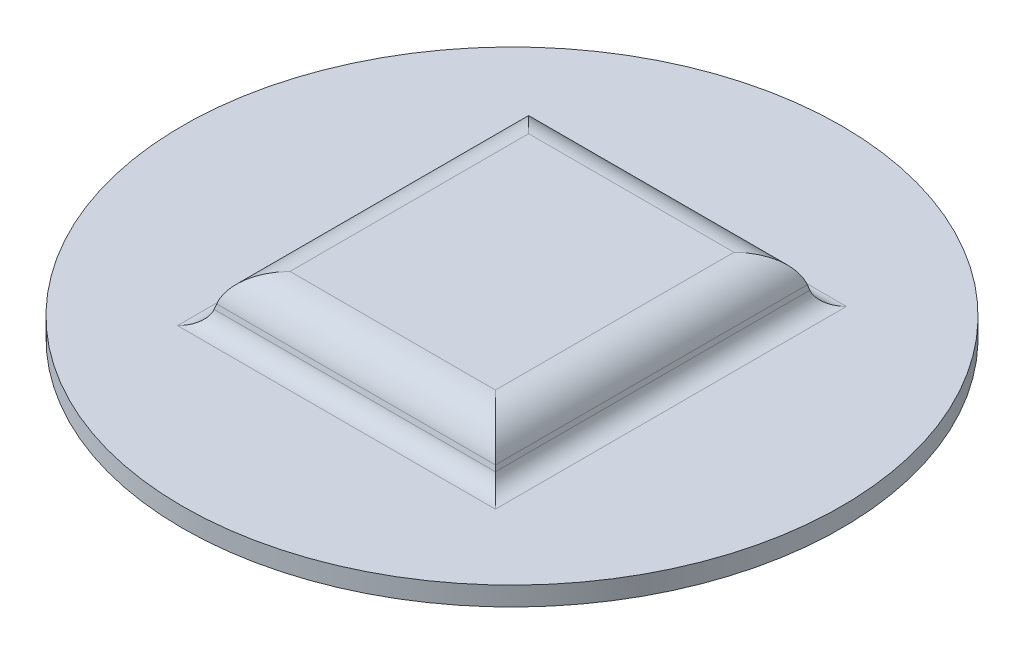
ISO-10303-21;
HEADER;
FILE_DESCRIPTION(('STEP AP214'),'2;1');
FILE_NAME('part.step','',(''),(''),'','','');
FILE_SCHEMA(('AUTOMOTIVE_DESIGN { 1 0 10303 214 1 1 1 1 }'));
ENDSEC;
DATA;
#1=APPLICATION_CONTEXT('core data for automotive mechanical design processes');
#2=APPLICATION_PROTOCOL_DEFINITION('international standard','automotive_design',2000,#1);
#3=PRODUCT_CONTEXT('',#1,'mechanical');
#4=PRODUCT('Part','Part','',(#3));
#5=PRODUCT_RELATED_PRODUCT_CATEGORY('part','',(#4));
#6=PRODUCT_DEFINITION_FORMATION('','',#4);
#7=PRODUCT_DEFINITION_CONTEXT('part definition',#1,'design');
#8=PRODUCT_DEFINITION('design','',#6,#7);
#9=PRODUCT_DEFINITION_SHAPE('','',#8);
#10=(LENGTH_UNIT() NAMED_UNIT(*) SI_UNIT(.MILLI.,.METRE.));
#11=(NAMED_UNIT(*) PLANE_ANGLE_UNIT() SI_UNIT($,.RADIAN.));
#12=(NAMED_UNIT(*) SI_UNIT($,.STERADIAN.) SOLID_ANGLE_UNIT());
#13=UNCERTAINTY_MEASURE_WITH_UNIT(LENGTH_MEASURE(1.E-05),#10,'distance_accuracy_value','');
#14=(GEOMETRIC_REPRESENTATION_CONTEXT(3) GLOBAL_UNCERTAINTY_ASSIGNED_CONTEXT((#13)) GLOBAL_UNIT_ASSIGNED_CONTEXT((#10,
#11,#12)) REPRESENTATION_CONTEXT('',''));
#15=CARTESIAN_POINT('',(0.,0.,0.));
#16=DIRECTION('',(0.,0.,1.));
#17=DIRECTION('',(1.,0.,0.));
#18=AXIS2_PLACEMENT_3D('',#15,#16,#17);
#19=CARTESIAN_POINT('',(0.,-0.9144,0.));
#20=DIRECTION('',(0.,1.,0.));
#21=DIRECTION('',(0.,0.,1.));
#22=AXIS2_PLACEMENT_3D('',#19,#20,#21);
#23=PLANE('',#22);
#24=DIRECTION('',(1.,0.,0.));
#25=VECTOR('',#24,1.);
#26=CARTESIAN_POINT('',(0.,-0.9144,7.04570394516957));
#27=LINE('',#26,#25);
#28=CARTESIAN_POINT('',(5.23447675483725,-0.9144,7.04570394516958));
#29=VERTEX_POINT('',#28);
#30=CARTESIAN_POINT('',(-4.6589480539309,-0.9144,7.04570394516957));
#31=VERTEX_POINT('',#30);
#32=EDGE_CURVE('E145',#29,#31,#27,.F.);
#33=ORIENTED_EDGE('',*,*,#32,.T.);
#34=DIRECTION('',(0.,0.,1.));
#35=VECTOR('',#34,1.);
#36=CARTESIAN_POINT('',(-4.6589480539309,-0.9144,0.));
#37=LINE('',#36,#35);
#38=CARTESIAN_POINT('',(-4.6589480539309,-0.9144,-4.44792086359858));
#39=VERTEX_POINT('',#38);
#40=EDGE_CURVE('E137',#31,#39,#37,.F.);
#41=ORIENTED_EDGE('',*,*,#40,.T.);
#42=DIRECTION('',(-1.,0.,0.));
#43=VECTOR('',#42,1.);
#44=CARTESIAN_POINT('',(0.,-0.9144,-4.44792086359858));
#45=LINE('',#44,#43);
#46=CARTESIAN_POINT('',(5.23447675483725,-0.9144,-4.44792086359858));
#47=VERTEX_POINT('',#46);
#48=EDGE_CURVE('E127',#39,#47,#45,.F.);
#49=ORIENTED_EDGE('',*,*,#48,.T.);
#50=DIRECTION('',(0.,0.,-1.));
#51=VECTOR('',#50,1.);
#52=CARTESIAN_POINT('',(5.23447675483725,-0.9144,0.));
#53=LINE('',#52,#51);
#54=EDGE_CURVE('E201',#47,#29,#53,.F.);
#55=ORIENTED_EDGE('',*,*,#54,.T.);
#56=EDGE_LOOP('',(#33,#41,#49,#55));
#57=FACE_BOUND('',#56,.T.);
#58=ADVANCED_FACE('F18',(#57),#23,.F.);
#59=CARTESIAN_POINT('',(0.,-1.8288,-4.44792086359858));
#60=DIRECTION('',(-1.,0.,0.));
#61=DIRECTION('',(0.,0.,1.));
#62=AXIS2_PLACEMENT_3D('',#59,#60,#61);
#63=CYLINDRICAL_SURFACE('',#62,0.9144);
#64=ORIENTED_EDGE('',*,*,#48,.F.);
#65=CARTESIAN_POINT('',(-4.6589480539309,-1.8288,-4.44792086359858));
#66=DIRECTION('',(-0.707106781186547,0.,0.707106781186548));
#67=DIRECTION('',(0.707106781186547,0.,0.707106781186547));
#68=AXIS2_PLACEMENT_3D('',#65,#66,#67);
#69=ELLIPSE('',#68,1.29315688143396,0.9144);
#70=CARTESIAN_POINT('',(-5.54219062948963,-1.59213586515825,-5.3311634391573));
#71=VERTEX_POINT('',#70);
#72=EDGE_CURVE('E21',#39,#71,#69,.T.);
#73=ORIENTED_EDGE('',*,*,#72,.T.);
#74=DIRECTION('',(1.,0.,0.));
#75=VECTOR('',#74,1.);
#76=CARTESIAN_POINT('',(-6.06223564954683,-1.59213586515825,-5.3311634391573));
#77=LINE('',#76,#75);
#78=CARTESIAN_POINT('',(6.11771933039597,-1.59213586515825,-5.3311634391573));
#79=VERTEX_POINT('',#78);
#80=EDGE_CURVE('E200',#71,#79,#77,.T.);
#81=ORIENTED_EDGE('',*,*,#80,.T.);
#82=CARTESIAN_POINT('',(5.23447675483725,-1.8288,-4.44792086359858));
#83=DIRECTION('',(-0.707106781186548,0.,-0.707106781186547));
#84=DIRECTION('',(0.707106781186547,0.,-0.707106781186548));
#85=AXIS2_PLACEMENT_3D('',#82,#83,#84);
#86=ELLIPSE('',#85,1.29315688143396,0.9144);
#87=EDGE_CURVE('E132',#79,#47,#86,.F.);
#88=ORIENTED_EDGE('',*,*,#87,.T.);
#89=EDGE_LOOP('',(#64,#73,#81,#88));
#90=FACE_BOUND('',#89,.T.);
#91=ADVANCED_FACE('F129',(#90),#63,.F.);
#92=CARTESIAN_POINT('',(-4.6589480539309,-1.8288,0.));
#93=DIRECTION('',(0.,0.,1.));
#94=DIRECTION('',(1.,0.,0.));
#95=AXIS2_PLACEMENT_3D('',#92,#93,#94);
#96=CYLINDRICAL_SURFACE('',#95,0.9144);
#97=DIRECTION('',(0.,0.,1.));
#98=VECTOR('',#97,1.);
#99=CARTESIAN_POINT('',(-5.54219062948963,-1.59213586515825,-5.8512084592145));
#100=LINE('',#99,#98);
#101=CARTESIAN_POINT('',(-5.54219062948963,-1.59213586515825,7.9289465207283));
#102=VERTEX_POINT('',#101);
#103=EDGE_CURVE('E144',#102,#71,#100,.F.);
#104=ORIENTED_EDGE('',*,*,#103,.T.);
#105=ORIENTED_EDGE('',*,*,#72,.F.);
#106=ORIENTED_EDGE('',*,*,#40,.F.);
#107=CARTESIAN_POINT('',(-4.6589480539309,-1.8288,7.04570394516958));
#108=DIRECTION('',(0.707106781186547,0.,0.707106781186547));
#109=DIRECTION('',(0.707106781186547,0.,-0.707106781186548));
#110=AXIS2_PLACEMENT_3D('',#107,#108,#109);
#111=ELLIPSE('',#110,1.29315688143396,0.9144);
#112=EDGE_CURVE('E202',#31,#102,#111,.T.);
#113=ORIENTED_EDGE('',*,*,#112,.T.);
#114=EDGE_LOOP('',(#104,#105,#106,#113));
#115=FACE_BOUND('',#114,.T.);
#116=ADVANCED_FACE('F141',(#115),#96,.F.);
#117=CARTESIAN_POINT('',(0.,-1.8288,7.04570394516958));
#118=DIRECTION('',(1.,0.,0.));
#119=DIRECTION('',(0.,0.,-1.));
#120=AXIS2_PLACEMENT_3D('',#117,#118,#119);
#121=CYLINDRICAL_SURFACE('',#120,0.9144);
#122=ORIENTED_EDGE('',*,*,#32,.F.);
#123=CARTESIAN_POINT('',(5.23447675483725,-1.8288,7.04570394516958));
#124=DIRECTION('',(0.707106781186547,0.,-0.707106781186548));
#125=DIRECTION('',(-0.707106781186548,0.,-0.707106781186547));
#126=AXIS2_PLACEMENT_3D('',#123,#124,#125);
#127=ELLIPSE('',#126,1.29315688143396,0.9144);
#128=CARTESIAN_POINT('',(6.11771933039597,-1.59213586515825,7.9289465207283));
#129=VERTEX_POINT('',#128);
#130=EDGE_CURVE('E197',#29,#129,#127,.T.);
#131=ORIENTED_EDGE('',*,*,#130,.T.);
#132=DIRECTION('',(1.,0.,0.));
#133=VECTOR('',#132,1.);
#134=CARTESIAN_POINT('',(-6.06223564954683,-1.59213586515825,7.9289465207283));
#135=LINE('',#134,#133);
#136=EDGE_CURVE('E212',#129,#102,#135,.F.);
#137=ORIENTED_EDGE('',*,*,#136,.T.);
#138=ORIENTED_EDGE('',*,*,#112,.F.);
#139=EDGE_LOOP('',(#122,#131,#137,#138));
#140=FACE_BOUND('',#139,.T.);
#141=ADVANCED_FACE('F217',(#140),#121,.F.);
#142=CARTESIAN_POINT('',(5.23447675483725,-1.8288,0.));
#143=DIRECTION('',(0.,0.,-1.));
#144=DIRECTION('',(-1.,0.,0.));
#145=AXIS2_PLACEMENT_3D('',#142,#143,#144);
#146=CYLINDRICAL_SURFACE('',#145,0.9144);
#147=ORIENTED_EDGE('',*,*,#54,.F.);
#148=ORIENTED_EDGE('',*,*,#87,.F.);
#149=DIRECTION('',(0.,0.,1.));
#150=VECTOR('',#149,1.);
#151=CARTESIAN_POINT('',(6.11771933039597,-1.59213586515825,-5.8512084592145));
#152=LINE('',#151,#150);
#153=EDGE_CURVE('E225',#79,#129,#152,.T.);
#154=ORIENTED_EDGE('',*,*,#153,.T.);
#155=ORIENTED_EDGE('',*,*,#130,.F.);
#156=EDGE_LOOP('',(#147,#148,#154,#155));
#157=FACE_BOUND('',#156,.T.);
#158=ADVANCED_FACE('F349',(#157),#146,.F.);
#159=CARTESIAN_POINT('',(0.,0.,0.));
#160=DIRECTION('',(0.,1.,0.));
#161=DIRECTION('',(0.,0.,1.));
#162=AXIS2_PLACEMENT_3D('',#159,#160,#161);
#163=PLANE('',#162);
#164=DIRECTION('',(0.,0.,1.));
#165=VECTOR('',#164,1.);
#166=CARTESIAN_POINT('',(-4.6589480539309,0.,0.));
#167=LINE('',#166,#165);
#168=CARTESIAN_POINT('',(-4.6589480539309,0.,7.04570394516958));
#169=VERTEX_POINT('',#168);
#170=CARTESIAN_POINT('',(-4.6589480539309,0.,-4.44792086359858));
#171=VERTEX_POINT('',#170);
#172=EDGE_CURVE('E196',#169,#171,#167,.F.);
#173=ORIENTED_EDGE('',*,*,#172,.F.);
#174=DIRECTION('',(1.,0.,0.));
#175=VECTOR('',#174,1.);
#176=CARTESIAN_POINT('',(0.,0.,7.04570394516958));
#177=LINE('',#176,#175);
#178=CARTESIAN_POINT('',(5.23447675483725,0.,7.04570394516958));
#179=VERTEX_POINT('',#178);
#180=EDGE_CURVE('E193',#179,#169,#177,.F.);
#181=ORIENTED_EDGE('',*,*,#180,.F.);
#182=DIRECTION('',(0.,0.,-1.));
#183=VECTOR('',#182,1.);
#184=CARTESIAN_POINT('',(5.23447675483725,0.,0.));
#185=LINE('',#184,#183);
#186=CARTESIAN_POINT('',(5.23447675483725,0.,-4.44792086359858));
#187=VERTEX_POINT('',#186);
#188=EDGE_CURVE('E190',#187,#179,#185,.F.);
#189=ORIENTED_EDGE('',*,*,#188,.F.);
#190=DIRECTION('',(-1.,0.,0.));
#191=VECTOR('',#190,1.);
#192=CARTESIAN_POINT('',(0.,0.,-4.44792086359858));
#193=LINE('',#192,#191);
#194=EDGE_CURVE('E187',#171,#187,#193,.F.);
#195=ORIENTED_EDGE('',*,*,#194,.F.);
#196=EDGE_LOOP('',(#173,#181,#189,#195));
#197=FACE_BOUND('',#196,.T.);
#198=ADVANCED_FACE('F347',(#197),#163,.T.);
#199=CARTESIAN_POINT('',(-6.06223564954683,-0.236664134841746,-4.96796588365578));
#200=DIRECTION('',(0.,0.258819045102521,-0.965925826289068));
#201=DIRECTION('',(0.,0.965925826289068,0.258819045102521));
#202=AXIS2_PLACEMENT_3D('',#199,#200,#201);
#203=PLANE('',#202);
#204=ORIENTED_EDGE('',*,*,#80,.F.);
#205=DIRECTION('',(-0.250562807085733,-0.935113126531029,-0.250562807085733));
#206=VECTOR('',#205,1.);
#207=CARTESIAN_POINT('',(-5.54219062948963,-1.59213586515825,-5.3311634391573));
#208=LINE('',#207,#206);
#209=CARTESIAN_POINT('',(-5.60312024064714,-1.81952826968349,-5.39209305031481));
#210=VERTEX_POINT('',#209);
#211=EDGE_CURVE('E220',#71,#210,#208,.T.);
#212=ORIENTED_EDGE('',*,*,#211,.T.);
#213=DIRECTION('',(-1.,0.,0.));
#214=VECTOR('',#213,1.);
#215=CARTESIAN_POINT('',(-6.06223564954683,-1.81952826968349,-5.39209305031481));
#216=LINE('',#215,#214);
#217=CARTESIAN_POINT('',(6.17864894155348,-1.81952826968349,-5.39209305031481));
#218=VERTEX_POINT('',#217);
#219=EDGE_CURVE('E183',#218,#210,#216,.T.);
#220=ORIENTED_EDGE('',*,*,#219,.F.);
#221=DIRECTION('',(-0.250562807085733,0.935113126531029,0.250562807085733));
#222=VECTOR('',#221,1.);
#223=CARTESIAN_POINT('',(6.17864894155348,-1.81952826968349,-5.39209305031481));
#224=LINE('',#223,#222);
#225=EDGE_CURVE('E215',#218,#79,#224,.T.);
#226=ORIENTED_EDGE('',*,*,#225,.T.);
#227=EDGE_LOOP('',(#204,#212,#220,#226));
#228=FACE_BOUND('',#227,.T.);
#229=ADVANCED_FACE('F240',(#228),#203,.F.);
#230=CARTESIAN_POINT('',(-5.1789930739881,-0.236664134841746,-5.8512084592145));
#231=DIRECTION('',(-0.965925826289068,0.258819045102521,0.));
#232=DIRECTION('',(-0.258819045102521,-0.965925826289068,0.));
#233=AXIS2_PLACEMENT_3D('',#230,#231,#232);
#234=PLANE('',#233);
#235=ORIENTED_EDGE('',*,*,#103,.F.);
#236=DIRECTION('',(-0.250562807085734,-0.935113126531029,0.25056280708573));
#237=VECTOR('',#236,1.);
#238=CARTESIAN_POINT('',(-5.54219062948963,-1.59213586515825,7.9289465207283));
#239=LINE('',#238,#237);
#240=CARTESIAN_POINT('',(-5.60312024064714,-1.81952826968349,7.98987613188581));
#241=VERTEX_POINT('',#240);
#242=EDGE_CURVE('E209',#102,#241,#239,.T.);
#243=ORIENTED_EDGE('',*,*,#242,.T.);
#244=DIRECTION('',(0.,0.,1.));
#245=VECTOR('',#244,1.);
#246=CARTESIAN_POINT('',(-5.60312024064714,-1.81952826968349,-5.8512084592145));
#247=LINE('',#246,#245);
#248=EDGE_CURVE('E179',#210,#241,#247,.T.);
#249=ORIENTED_EDGE('',*,*,#248,.F.);
#250=ORIENTED_EDGE('',*,*,#211,.F.);
#251=EDGE_LOOP('',(#235,#243,#249,#250));
#252=FACE_BOUND('',#251,.T.);
#253=ADVANCED_FACE('F356',(#252),#234,.F.);
#254=CARTESIAN_POINT('',(-6.06223564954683,-0.236664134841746,7.56574896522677));
#255=DIRECTION('',(0.,0.258819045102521,0.965925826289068));
#256=DIRECTION('',(0.,-0.965925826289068,0.258819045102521));
#257=AXIS2_PLACEMENT_3D('',#254,#255,#256);
#258=PLANE('',#257);
#259=ORIENTED_EDGE('',*,*,#136,.F.);
#260=DIRECTION('',(0.250562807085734,-0.935113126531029,0.25056280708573));
#261=VECTOR('',#260,1.);
#262=CARTESIAN_POINT('',(6.11771933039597,-1.59213586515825,7.92894652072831));
#263=LINE('',#262,#261);
#264=CARTESIAN_POINT('',(6.17864894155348,-1.81952826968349,7.98987613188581));
#265=VERTEX_POINT('',#264);
#266=EDGE_CURVE('E228',#129,#265,#263,.T.);
#267=ORIENTED_EDGE('',*,*,#266,.T.);
#268=DIRECTION('',(1.,0.,0.));
#269=VECTOR('',#268,1.);
#270=CARTESIAN_POINT('',(-6.06223564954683,-1.81952826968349,7.98987613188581));
#271=LINE('',#270,#269);
#272=EDGE_CURVE('E175',#241,#265,#271,.T.);
#273=ORIENTED_EDGE('',*,*,#272,.F.);
#274=ORIENTED_EDGE('',*,*,#242,.F.);
#275=EDGE_LOOP('',(#259,#267,#273,#274));
#276=FACE_BOUND('',#275,.T.);
#277=ADVANCED_FACE('F210',(#276),#258,.F.);
#278=CARTESIAN_POINT('',(5.75452177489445,-0.236664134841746,-5.8512084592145));
#279=DIRECTION('',(0.965925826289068,0.258819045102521,0.));
#280=DIRECTION('',(-0.258819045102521,0.965925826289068,0.));
#281=AXIS2_PLACEMENT_3D('',#278,#279,#280);
#282=PLANE('',#281);
#283=ORIENTED_EDGE('',*,*,#153,.F.);
#284=ORIENTED_EDGE('',*,*,#225,.F.);
#285=DIRECTION('',(0.,0.,-1.));
#286=VECTOR('',#285,1.);
#287=CARTESIAN_POINT('',(6.17864894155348,-1.81952826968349,-5.8512084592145));
#288=LINE('',#287,#286);
#289=EDGE_CURVE('E171',#265,#218,#288,.T.);
#290=ORIENTED_EDGE('',*,*,#289,.F.);
#291=ORIENTED_EDGE('',*,*,#266,.F.);
#292=EDGE_LOOP('',(#283,#284,#290,#291));
#293=FACE_BOUND('',#292,.T.);
#294=ADVANCED_FACE('F235',(#293),#282,.F.);
#295=CARTESIAN_POINT('',(-4.6589480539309,-1.8288,0.));
#296=DIRECTION('',(0.,0.,1.));
#297=DIRECTION('',(1.,0.,0.));
#298=AXIS2_PLACEMENT_3D('',#295,#296,#297);
#299=CYLINDRICAL_SURFACE('',#298,1.8288);
#300=CARTESIAN_POINT('',(-4.6589480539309,-1.8288,-4.44792086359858));
#301=DIRECTION('',(-0.707106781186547,0.,0.707106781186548));
#302=DIRECTION('',(-0.707106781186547,0.,-0.707106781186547));
#303=AXIS2_PLACEMENT_3D('',#300,#301,#302);
#304=ELLIPSE('',#303,2.58631376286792,1.8288);
#305=CARTESIAN_POINT('',(-6.42543320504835,-1.35547173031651,-6.21440601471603));
#306=VERTEX_POINT('',#305);
#307=EDGE_CURVE('E184',#306,#171,#304,.F.);
#308=ORIENTED_EDGE('',*,*,#307,.F.);
#309=DIRECTION('',(0.,0.,1.));
#310=VECTOR('',#309,1.);
#311=CARTESIAN_POINT('',(-6.42543320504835,-1.35547173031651,-5.8512084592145));
#312=LINE('',#311,#310);
#313=CARTESIAN_POINT('',(-6.42543320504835,-1.35547173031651,8.81218909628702));
#314=VERTEX_POINT('',#313);
#315=EDGE_CURVE('E170',#314,#306,#312,.F.);
#316=ORIENTED_EDGE('',*,*,#315,.F.);
#317=CARTESIAN_POINT('',(-4.6589480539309,-1.8288,7.04570394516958));
#318=DIRECTION('',(0.707106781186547,0.,0.707106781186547));
#319=DIRECTION('',(0.707106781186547,0.,-0.707106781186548));
#320=AXIS2_PLACEMENT_3D('',#317,#318,#319);
#321=ELLIPSE('',#320,2.58631376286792,1.8288);
#322=EDGE_CURVE('E194',#169,#314,#321,.T.);
#323=ORIENTED_EDGE('',*,*,#322,.F.);
#324=ORIENTED_EDGE('',*,*,#172,.T.);
#325=EDGE_LOOP('',(#308,#316,#323,#324));
#326=FACE_BOUND('',#325,.T.);
#327=ADVANCED_FACE('F328',(#326),#299,.T.);
#328=CARTESIAN_POINT('',(0.,-1.8288,7.04570394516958));
#329=DIRECTION('',(1.,0.,0.));
#330=DIRECTION('',(0.,0.,-1.));
#331=AXIS2_PLACEMENT_3D('',#328,#329,#330);
#332=CYLINDRICAL_SURFACE('',#331,1.8288);
#333=CARTESIAN_POINT('',(5.23447675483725,-1.8288,7.04570394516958));
#334=DIRECTION('',(0.707106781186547,0.,-0.707106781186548));
#335=DIRECTION('',(-0.707106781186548,0.,-0.707106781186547));
#336=AXIS2_PLACEMENT_3D('',#333,#334,#335);
#337=ELLIPSE('',#336,2.58631376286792,1.8288);
#338=CARTESIAN_POINT('',(7.0009619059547,-1.35547173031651,8.81218909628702));
#339=VERTEX_POINT('',#338);
#340=EDGE_CURVE('E191',#179,#339,#337,.T.);
#341=ORIENTED_EDGE('',*,*,#340,.F.);
#342=ORIENTED_EDGE('',*,*,#180,.T.);
#343=ORIENTED_EDGE('',*,*,#322,.T.);
#344=DIRECTION('',(1.,0.,0.));
#345=VECTOR('',#344,1.);
#346=CARTESIAN_POINT('',(-6.06223564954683,-1.35547173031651,8.81218909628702));
#347=LINE('',#346,#345);
#348=EDGE_CURVE('E248',#339,#314,#347,.F.);
#349=ORIENTED_EDGE('',*,*,#348,.F.);
#350=EDGE_LOOP('',(#341,#342,#343,#349));
#351=FACE_BOUND('',#350,.T.);
#352=ADVANCED_FACE('F336',(#351),#332,.T.);
#353=CARTESIAN_POINT('',(5.23447675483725,-1.8288,0.));
#354=DIRECTION('',(0.,0.,-1.));
#355=DIRECTION('',(-1.,0.,0.));
#356=AXIS2_PLACEMENT_3D('',#353,#354,#355);
#357=CYLINDRICAL_SURFACE('',#356,1.8288);
#358=CARTESIAN_POINT('',(5.23447675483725,-1.8288,-4.44792086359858));
#359=DIRECTION('',(-0.707106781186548,0.,-0.707106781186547));
#360=DIRECTION('',(-0.707106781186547,0.,0.707106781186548));
#361=AXIS2_PLACEMENT_3D('',#358,#359,#360);
#362=ELLIPSE('',#361,2.58631376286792,1.8288);
#363=CARTESIAN_POINT('',(7.0009619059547,-1.35547173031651,-6.21440601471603));
#364=VERTEX_POINT('',#363);
#365=EDGE_CURVE('E188',#187,#364,#362,.T.);
#366=ORIENTED_EDGE('',*,*,#365,.F.);
#367=ORIENTED_EDGE('',*,*,#188,.T.);
#368=ORIENTED_EDGE('',*,*,#340,.T.);
#369=DIRECTION('',(0.,0.,1.));
#370=VECTOR('',#369,1.);
#371=CARTESIAN_POINT('',(7.0009619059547,-1.35547173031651,-5.8512084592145));
#372=LINE('',#371,#370);
#373=EDGE_CURVE('E255',#364,#339,#372,.T.);
#374=ORIENTED_EDGE('',*,*,#373,.F.);
#375=EDGE_LOOP('',(#366,#367,#368,#374));
#376=FACE_BOUND('',#375,.T.);
#377=ADVANCED_FACE('F342',(#376),#357,.T.);
#378=CARTESIAN_POINT('',(0.,-1.8288,-4.44792086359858));
#379=DIRECTION('',(-1.,0.,0.));
#380=DIRECTION('',(0.,0.,1.));
#381=AXIS2_PLACEMENT_3D('',#378,#379,#380);
#382=CYLINDRICAL_SURFACE('',#381,1.8288);
#383=ORIENTED_EDGE('',*,*,#307,.T.);
#384=ORIENTED_EDGE('',*,*,#194,.T.);
#385=ORIENTED_EDGE('',*,*,#365,.T.);
#386=DIRECTION('',(1.,0.,0.));
#387=VECTOR('',#386,1.);
#388=CARTESIAN_POINT('',(-6.06223564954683,-1.35547173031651,-6.21440601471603));
#389=LINE('',#388,#387);
#390=EDGE_CURVE('E260',#306,#364,#389,.T.);
#391=ORIENTED_EDGE('',*,*,#390,.F.);
#392=EDGE_LOOP('',(#383,#384,#385,#391));
#393=FACE_BOUND('',#392,.T.);
#394=ADVANCED_FACE('F344',(#393),#382,.T.);
#395=CARTESIAN_POINT('',(-6.06223564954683,-1.3462,-7.15857820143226));
#396=DIRECTION('',(-1.,0.,0.));
#397=DIRECTION('',(0.,0.,1.));
#398=AXIS2_PLACEMENT_3D('',#395,#396,#397);
#399=CYLINDRICAL_SURFACE('',#398,1.8288);
#400=CARTESIAN_POINT('',(7.94513409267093,-1.3462,-7.15857820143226));
#401=DIRECTION('',(-0.707106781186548,0.,-0.707106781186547));
#402=DIRECTION('',(-0.707106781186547,0.,0.707106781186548));
#403=AXIS2_PLACEMENT_3D('',#400,#401,#402);
#404=ELLIPSE('',#403,2.58631376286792,1.8288);
#405=CARTESIAN_POINT('',(7.94513409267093,-3.175,-7.15857820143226));
#406=VERTEX_POINT('',#405);
#407=EDGE_CURVE('E168',#218,#406,#404,.F.);
#408=ORIENTED_EDGE('',*,*,#407,.F.);
#409=ORIENTED_EDGE('',*,*,#219,.T.);
#410=CARTESIAN_POINT('',(-7.36960539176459,-1.3462,-7.15857820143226));
#411=DIRECTION('',(-0.707106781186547,0.,0.707106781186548));
#412=DIRECTION('',(-0.707106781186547,0.,-0.707106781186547));
#413=AXIS2_PLACEMENT_3D('',#410,#411,#412);
#414=ELLIPSE('',#413,2.58631376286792,1.8288);
#415=CARTESIAN_POINT('',(-7.36960539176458,-3.175,-7.15857820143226));
#416=VERTEX_POINT('',#415);
#417=EDGE_CURVE('E180',#416,#210,#414,.T.);
#418=ORIENTED_EDGE('',*,*,#417,.F.);
#419=DIRECTION('',(1.,0.,0.));
#420=VECTOR('',#419,1.);
#421=CARTESIAN_POINT('',(0.287764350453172,-3.175,-7.15857820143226));
#422=LINE('',#421,#420);
#423=EDGE_CURVE('E263',#406,#416,#422,.F.);
#424=ORIENTED_EDGE('',*,*,#423,.F.);
#425=EDGE_LOOP('',(#408,#409,#418,#424));
#426=FACE_BOUND('',#425,.T.);
#427=ADVANCED_FACE('F401',(#426),#399,.T.);
#428=CARTESIAN_POINT('',(-7.36960539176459,-1.3462,-5.8512084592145));
#429=DIRECTION('',(0.,0.,1.));
#430=DIRECTION('',(1.,0.,0.));
#431=AXIS2_PLACEMENT_3D('',#428,#429,#430);
#432=CYLINDRICAL_SURFACE('',#431,1.8288);
#433=CARTESIAN_POINT('',(-7.36960539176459,-1.3462,9.75636128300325));
#434=DIRECTION('',(0.707106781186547,0.,0.707106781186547));
#435=DIRECTION('',(-0.707106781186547,0.,0.707106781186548));
#436=AXIS2_PLACEMENT_3D('',#433,#434,#435);
#437=ELLIPSE('',#436,2.58631376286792,1.8288);
#438=CARTESIAN_POINT('',(-7.36960539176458,-3.175,9.75636128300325));
#439=VERTEX_POINT('',#438);
#440=EDGE_CURVE('E176',#439,#241,#437,.T.);
#441=ORIENTED_EDGE('',*,*,#440,.F.);
#442=DIRECTION('',(0.,0.,-1.));
#443=VECTOR('',#442,1.);
#444=CARTESIAN_POINT('',(-7.36960539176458,-3.175,1.2988915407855));
#445=LINE('',#444,#443);
#446=EDGE_CURVE('E269',#416,#439,#445,.F.);
#447=ORIENTED_EDGE('',*,*,#446,.F.);
#448=ORIENTED_EDGE('',*,*,#417,.T.);
#449=ORIENTED_EDGE('',*,*,#248,.T.);
#450=EDGE_LOOP('',(#441,#447,#448,#449));
#451=FACE_BOUND('',#450,.T.);
#452=ADVANCED_FACE('F397',(#451),#432,.T.);
#453=CARTESIAN_POINT('',(-6.06223564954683,-1.3462,9.75636128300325));
#454=DIRECTION('',(1.,0.,0.));
#455=DIRECTION('',(0.,0.,-1.));
#456=AXIS2_PLACEMENT_3D('',#453,#454,#455);
#457=CYLINDRICAL_SURFACE('',#456,1.8288);
#458=CARTESIAN_POINT('',(7.94513409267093,-1.3462,9.75636128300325));
#459=DIRECTION('',(0.707106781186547,0.,-0.707106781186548));
#460=DIRECTION('',(0.707106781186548,0.,0.707106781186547));
#461=AXIS2_PLACEMENT_3D('',#458,#459,#460);
#462=ELLIPSE('',#461,2.58631376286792,1.8288);
#463=CARTESIAN_POINT('',(7.94513409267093,-3.175,9.75636128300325));
#464=VERTEX_POINT('',#463);
#465=EDGE_CURVE('E172',#464,#265,#462,.T.);
#466=ORIENTED_EDGE('',*,*,#465,.F.);
#467=DIRECTION('',(1.,0.,0.));
#468=VECTOR('',#467,1.);
#469=CARTESIAN_POINT('',(0.287764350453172,-3.175,9.75636128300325));
#470=LINE('',#469,#468);
#471=EDGE_CURVE('E271',#439,#464,#470,.T.);
#472=ORIENTED_EDGE('',*,*,#471,.F.);
#473=ORIENTED_EDGE('',*,*,#440,.T.);
#474=ORIENTED_EDGE('',*,*,#272,.T.);
#475=EDGE_LOOP('',(#466,#472,#473,#474));
#476=FACE_BOUND('',#475,.T.);
#477=ADVANCED_FACE('F393',(#476),#457,.T.);
#478=CARTESIAN_POINT('',(7.94513409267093,-1.3462,-5.8512084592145));
#479=DIRECTION('',(0.,0.,-1.));
#480=DIRECTION('',(-1.,0.,0.));
#481=AXIS2_PLACEMENT_3D('',#478,#479,#480);
#482=CYLINDRICAL_SURFACE('',#481,1.8288);
#483=ORIENTED_EDGE('',*,*,#407,.T.);
#484=DIRECTION('',(0.,0.,-1.));
#485=VECTOR('',#484,1.);
#486=CARTESIAN_POINT('',(7.94513409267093,-3.175,1.2988915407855));
#487=LINE('',#486,#485);
#488=EDGE_CURVE('E274',#464,#406,#487,.T.);
#489=ORIENTED_EDGE('',*,*,#488,.F.);
#490=ORIENTED_EDGE('',*,*,#465,.T.);
#491=ORIENTED_EDGE('',*,*,#289,.T.);
#492=EDGE_LOOP('',(#483,#489,#490,#491));
#493=FACE_BOUND('',#492,.T.);
#494=ADVANCED_FACE('F390',(#493),#482,.T.);
#495=CARTESIAN_POINT('',(-6.06223564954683,0.,-5.8512084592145));
#496=DIRECTION('',(-0.965925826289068,0.258819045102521,0.));
#497=DIRECTION('',(-0.258819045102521,-0.965925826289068,0.));
#498=AXIS2_PLACEMENT_3D('',#495,#496,#497);
#499=PLANE('',#498);
#500=DIRECTION('',(-0.250562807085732,-0.93511312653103,0.250562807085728));
#501=VECTOR('',#500,1.);
#502=CARTESIAN_POINT('',(-6.42543320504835,-1.35547173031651,8.81218909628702));
#503=LINE('',#502,#501);
#504=CARTESIAN_POINT('',(-6.48636281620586,-1.58286413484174,8.87311870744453));
#505=VERTEX_POINT('',#504);
#506=EDGE_CURVE('E252',#314,#505,#503,.T.);
#507=ORIENTED_EDGE('',*,*,#506,.F.);
#508=ORIENTED_EDGE('',*,*,#315,.T.);
#509=DIRECTION('',(0.250562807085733,0.935113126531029,0.250562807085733));
#510=VECTOR('',#509,1.);
#511=CARTESIAN_POINT('',(-6.48636281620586,-1.58286413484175,-6.27533562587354));
#512=LINE('',#511,#510);
#513=CARTESIAN_POINT('',(-6.48636281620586,-1.58286413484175,-6.27533562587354));
#514=VERTEX_POINT('',#513);
#515=EDGE_CURVE('E264',#514,#306,#512,.T.);
#516=ORIENTED_EDGE('',*,*,#515,.F.);
#517=DIRECTION('',(0.,0.,1.));
#518=VECTOR('',#517,1.);
#519=CARTESIAN_POINT('',(-6.48636281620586,-1.58286413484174,-5.8512084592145));
#520=LINE('',#519,#518);
#521=EDGE_CURVE('E277',#514,#505,#520,.T.);
#522=ORIENTED_EDGE('',*,*,#521,.T.);
#523=EDGE_LOOP('',(#507,#508,#516,#522));
#524=FACE_BOUND('',#523,.T.);
#525=ADVANCED_FACE('F324',(#524),#499,.T.);
#526=CARTESIAN_POINT('',(-6.06223564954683,0.,8.4489915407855));
#527=DIRECTION('',(0.,0.258819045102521,0.965925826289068));
#528=DIRECTION('',(0.,-0.965925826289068,0.258819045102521));
#529=AXIS2_PLACEMENT_3D('',#526,#527,#528);
#530=PLANE('',#529);
#531=DIRECTION('',(0.250562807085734,-0.935113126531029,0.25056280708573));
#532=VECTOR('',#531,1.);
#533=CARTESIAN_POINT('',(7.0009619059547,-1.35547173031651,8.81218909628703));
#534=LINE('',#533,#532);
#535=CARTESIAN_POINT('',(7.06189151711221,-1.58286413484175,8.87311870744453));
#536=VERTEX_POINT('',#535);
#537=EDGE_CURVE('E251',#339,#536,#534,.T.);
#538=ORIENTED_EDGE('',*,*,#537,.F.);
#539=ORIENTED_EDGE('',*,*,#348,.T.);
#540=ORIENTED_EDGE('',*,*,#506,.T.);
#541=DIRECTION('',(1.,0.,0.));
#542=VECTOR('',#541,1.);
#543=CARTESIAN_POINT('',(-6.06223564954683,-1.58286413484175,8.87311870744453));
#544=LINE('',#543,#542);
#545=EDGE_CURVE('E167',#505,#536,#544,.T.);
#546=ORIENTED_EDGE('',*,*,#545,.T.);
#547=EDGE_LOOP('',(#538,#539,#540,#546));
#548=FACE_BOUND('',#547,.T.);
#549=ADVANCED_FACE('F333',(#548),#530,.T.);
#550=CARTESIAN_POINT('',(6.63776435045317,0.,-5.8512084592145));
#551=DIRECTION('',(0.965925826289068,0.258819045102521,0.));
#552=DIRECTION('',(-0.258819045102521,0.965925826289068,0.));
#553=AXIS2_PLACEMENT_3D('',#550,#551,#552);
#554=PLANE('',#553);
#555=DIRECTION('',(0.250562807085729,-0.935113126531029,-0.250562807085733));
#556=VECTOR('',#555,1.);
#557=CARTESIAN_POINT('',(7.00096190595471,-1.35547173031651,-6.21440601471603));
#558=LINE('',#557,#556);
#559=CARTESIAN_POINT('',(7.06189151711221,-1.58286413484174,-6.27533562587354));
#560=VERTEX_POINT('',#559);
#561=EDGE_CURVE('E258',#364,#560,#558,.T.);
#562=ORIENTED_EDGE('',*,*,#561,.F.);
#563=ORIENTED_EDGE('',*,*,#373,.T.);
#564=ORIENTED_EDGE('',*,*,#537,.T.);
#565=DIRECTION('',(0.,0.,-1.));
#566=VECTOR('',#565,1.);
#567=CARTESIAN_POINT('',(7.06189151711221,-1.58286413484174,-5.8512084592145));
#568=LINE('',#567,#566);
#569=EDGE_CURVE('E163',#536,#560,#568,.T.);
#570=ORIENTED_EDGE('',*,*,#569,.T.);
#571=EDGE_LOOP('',(#562,#563,#564,#570));
#572=FACE_BOUND('',#571,.T.);
#573=ADVANCED_FACE('F339',(#572),#554,.T.);
#574=CARTESIAN_POINT('',(-6.06223564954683,0.,-5.8512084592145));
#575=DIRECTION('',(0.,0.258819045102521,-0.965925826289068));
#576=DIRECTION('',(0.,0.965925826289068,0.258819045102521));
#577=AXIS2_PLACEMENT_3D('',#574,#575,#576);
#578=PLANE('',#577);
#579=ORIENTED_EDGE('',*,*,#515,.T.);
#580=ORIENTED_EDGE('',*,*,#390,.T.);
#581=ORIENTED_EDGE('',*,*,#561,.T.);
#582=DIRECTION('',(-1.,0.,0.));
#583=VECTOR('',#582,1.);
#584=CARTESIAN_POINT('',(-6.06223564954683,-1.58286413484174,-6.27533562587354));
#585=LINE('',#584,#583);
#586=EDGE_CURVE('E158',#560,#514,#585,.T.);
#587=ORIENTED_EDGE('',*,*,#586,.T.);
#588=EDGE_LOOP('',(#579,#580,#581,#587));
#589=FACE_BOUND('',#588,.T.);
#590=ADVANCED_FACE('F302',(#589),#578,.T.);
#591=CARTESIAN_POINT('',(0.287764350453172,-3.175,1.2988915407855));
#592=DIRECTION('',(0.,-1.,0.));
#593=DIRECTION('',(0.,0.,-1.));
#594=AXIS2_PLACEMENT_3D('',#591,#592,#593);
#595=PLANE('',#594);
#596=CARTESIAN_POINT('',(0.287764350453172,-3.175,1.2988915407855));
#597=DIRECTION('',(0.,-1.,0.));
#598=DIRECTION('',(0.,0.,-1.));
#599=AXIS2_PLACEMENT_3D('',#596,#597,#598);
#600=CIRCLE('',#599,15.875);
#601=CARTESIAN_POINT('',(0.287764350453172,-3.175,-14.5761084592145));
#602=VERTEX_POINT('',#601);
#603=EDGE_CURVE('E151',#602,#602,#600,.F.);
#604=ORIENTED_EDGE('',*,*,#603,.F.);
#605=EDGE_LOOP('',(#604));
#606=FACE_BOUND('',#605,.T.);
#607=ORIENTED_EDGE('',*,*,#471,.T.);
#608=ORIENTED_EDGE('',*,*,#488,.T.);
#609=ORIENTED_EDGE('',*,*,#423,.T.);
#610=ORIENTED_EDGE('',*,*,#446,.T.);
#611=EDGE_LOOP('',(#607,#608,#609,#610));
#612=FACE_BOUND('',#611,.T.);
#613=ADVANCED_FACE('F378',(#606,#612),#595,.T.);
#614=CARTESIAN_POINT('',(-7.36960539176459,-1.3462,-5.8512084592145));
#615=DIRECTION('',(0.,0.,1.));
#616=DIRECTION('',(1.,0.,0.));
#617=AXIS2_PLACEMENT_3D('',#614,#615,#616);
#618=CYLINDRICAL_SURFACE('',#617,0.9144);
#619=DIRECTION('',(0.,0.,-1.));
#620=VECTOR('',#619,1.);
#621=CARTESIAN_POINT('',(-7.36960539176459,-2.2606,1.2988915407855));
#622=LINE('',#621,#620);
#623=CARTESIAN_POINT('',(-7.36960539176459,-2.2606,-7.15857820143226));
#624=VERTEX_POINT('',#623);
#625=CARTESIAN_POINT('',(-7.36960539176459,-2.2606,9.75636128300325));
#626=VERTEX_POINT('',#625);
#627=EDGE_CURVE('E154',#624,#626,#622,.F.);
#628=ORIENTED_EDGE('',*,*,#627,.T.);
#629=CARTESIAN_POINT('',(-7.36960539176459,-1.3462,9.75636128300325));
#630=DIRECTION('',(0.707106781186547,0.,0.707106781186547));
#631=DIRECTION('',(-0.707106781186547,0.,0.707106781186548));
#632=AXIS2_PLACEMENT_3D('',#629,#630,#631);
#633=ELLIPSE('',#632,1.29315688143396,0.9144);
#634=EDGE_CURVE('E164',#626,#505,#633,.T.);
#635=ORIENTED_EDGE('',*,*,#634,.T.);
#636=ORIENTED_EDGE('',*,*,#521,.F.);
#637=CARTESIAN_POINT('',(-7.36960539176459,-1.3462,-7.15857820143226));
#638=DIRECTION('',(-0.707106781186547,0.,0.707106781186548));
#639=DIRECTION('',(0.707106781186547,0.,0.707106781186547));
#640=AXIS2_PLACEMENT_3D('',#637,#638,#639);
#641=ELLIPSE('',#640,1.29315688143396,0.9144);
#642=EDGE_CURVE('E155',#514,#624,#641,.F.);
#643=ORIENTED_EDGE('',*,*,#642,.T.);
#644=EDGE_LOOP('',(#628,#635,#636,#643));
#645=FACE_BOUND('',#644,.T.);
#646=ADVANCED_FACE('F321',(#645),#618,.F.);
#647=CARTESIAN_POINT('',(-6.06223564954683,-1.3462,9.75636128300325));
#648=DIRECTION('',(1.,0.,0.));
#649=DIRECTION('',(0.,0.,-1.));
#650=AXIS2_PLACEMENT_3D('',#647,#648,#649);
#651=CYLINDRICAL_SURFACE('',#650,0.914399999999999);
#652=DIRECTION('',(1.,0.,0.));
#653=VECTOR('',#652,1.);
#654=CARTESIAN_POINT('',(0.287764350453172,-2.2606,9.75636128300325));
#655=LINE('',#654,#653);
#656=CARTESIAN_POINT('',(7.94513409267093,-2.2606,9.75636128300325));
#657=VERTEX_POINT('',#656);
#658=EDGE_CURVE('E289',#626,#657,#655,.T.);
#659=ORIENTED_EDGE('',*,*,#658,.T.);
#660=CARTESIAN_POINT('',(7.94513409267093,-1.3462,9.75636128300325));
#661=DIRECTION('',(0.707106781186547,0.,-0.707106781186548));
#662=DIRECTION('',(0.707106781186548,0.,0.707106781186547));
#663=AXIS2_PLACEMENT_3D('',#660,#661,#662);
#664=ELLIPSE('',#663,1.29315688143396,0.9144);
#665=EDGE_CURVE('E160',#657,#536,#664,.T.);
#666=ORIENTED_EDGE('',*,*,#665,.T.);
#667=ORIENTED_EDGE('',*,*,#545,.F.);
#668=ORIENTED_EDGE('',*,*,#634,.F.);
#669=EDGE_LOOP('',(#659,#666,#667,#668));
#670=FACE_BOUND('',#669,.T.);
#671=ADVANCED_FACE('F318',(#670),#651,.F.);
#672=CARTESIAN_POINT('',(7.94513409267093,-1.3462,-5.8512084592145));
#673=DIRECTION('',(0.,0.,-1.));
#674=DIRECTION('',(-1.,0.,0.));
#675=AXIS2_PLACEMENT_3D('',#672,#673,#674);
#676=CYLINDRICAL_SURFACE('',#675,0.9144);
#677=DIRECTION('',(0.,0.,-1.));
#678=VECTOR('',#677,1.);
#679=CARTESIAN_POINT('',(7.94513409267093,-2.2606,1.2988915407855));
#680=LINE('',#679,#678);
#681=CARTESIAN_POINT('',(7.94513409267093,-2.2606,-7.15857820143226));
#682=VERTEX_POINT('',#681);
#683=EDGE_CURVE('E292',#657,#682,#680,.T.);
#684=ORIENTED_EDGE('',*,*,#683,.T.);
#685=CARTESIAN_POINT('',(7.94513409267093,-1.3462,-7.15857820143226));
#686=DIRECTION('',(-0.707106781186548,0.,-0.707106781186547));
#687=DIRECTION('',(0.707106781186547,0.,-0.707106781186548));
#688=AXIS2_PLACEMENT_3D('',#685,#686,#687);
#689=ELLIPSE('',#688,1.29315688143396,0.9144);
#690=EDGE_CURVE('E36',#682,#560,#689,.T.);
#691=ORIENTED_EDGE('',*,*,#690,.T.);
#692=ORIENTED_EDGE('',*,*,#569,.F.);
#693=ORIENTED_EDGE('',*,*,#665,.F.);
#694=EDGE_LOOP('',(#684,#691,#692,#693));
#695=FACE_BOUND('',#694,.T.);
#696=ADVANCED_FACE('F311',(#695),#676,.F.);
#697=CARTESIAN_POINT('',(-6.06223564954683,-1.3462,-7.15857820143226));
#698=DIRECTION('',(-1.,0.,0.));
#699=DIRECTION('',(0.,0.,1.));
#700=AXIS2_PLACEMENT_3D('',#697,#698,#699);
#701=CYLINDRICAL_SURFACE('',#700,0.9144);
#702=ORIENTED_EDGE('',*,*,#586,.F.);
#703=ORIENTED_EDGE('',*,*,#690,.F.);
#704=DIRECTION('',(1.,0.,0.));
#705=VECTOR('',#704,1.);
#706=CARTESIAN_POINT('',(0.287764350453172,-2.2606,-7.15857820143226));
#707=LINE('',#706,#705);
#708=EDGE_CURVE('E27',#682,#624,#707,.F.);
#709=ORIENTED_EDGE('',*,*,#708,.T.);
#710=ORIENTED_EDGE('',*,*,#642,.F.);
#711=EDGE_LOOP('',(#702,#703,#709,#710));
#712=FACE_BOUND('',#711,.T.);
#713=ADVANCED_FACE('F308',(#712),#701,.F.);
#714=CARTESIAN_POINT('',(0.287764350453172,-2.2606,1.2988915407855));
#715=DIRECTION('',(0.,-1.,0.));
#716=DIRECTION('',(0.,0.,-1.));
#717=AXIS2_PLACEMENT_3D('',#714,#715,#716);
#718=CYLINDRICAL_SURFACE('',#717,15.875);
#719=ORIENTED_EDGE('',*,*,#603,.T.);
#720=EDGE_LOOP('',(#719));
#721=FACE_BOUND('',#720,.T.);
#722=CARTESIAN_POINT('',(0.287764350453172,-2.2606,1.2988915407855));
#723=DIRECTION('',(0.,-1.,0.));
#724=DIRECTION('',(0.,0.,-1.));
#725=AXIS2_PLACEMENT_3D('',#722,#723,#724);
#726=CIRCLE('',#725,15.875);
#727=CARTESIAN_POINT('',(0.287764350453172,-2.2606,-14.5761084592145));
#728=VERTEX_POINT('',#727);
#729=EDGE_CURVE('E11',#728,#728,#726,.T.);
#730=ORIENTED_EDGE('',*,*,#729,.T.);
#731=EDGE_LOOP('',(#730));
#732=FACE_BOUND('',#731,.T.);
#733=ADVANCED_FACE('F360',(#721,#732),#718,.T.);
#734=CARTESIAN_POINT('',(0.287764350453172,-2.2606,1.2988915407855));
#735=DIRECTION('',(0.,-1.,0.));
#736=DIRECTION('',(0.,0.,-1.));
#737=AXIS2_PLACEMENT_3D('',#734,#735,#736);
#738=PLANE('',#737);
#739=ORIENTED_EDGE('',*,*,#729,.F.);
#740=EDGE_LOOP('',(#739));
#741=FACE_BOUND('',#740,.T.);
#742=ORIENTED_EDGE('',*,*,#683,.F.);
#743=ORIENTED_EDGE('',*,*,#658,.F.);
#744=ORIENTED_EDGE('',*,*,#627,.F.);
#745=ORIENTED_EDGE('',*,*,#708,.F.);
#746=EDGE_LOOP('',(#742,#743,#744,#745));
#747=FACE_BOUND('',#746,.T.);
#748=ADVANCED_FACE('F315',(#741,#747),#738,.F.);
#749=CLOSED_SHELL('',(#58,#91,#116,#141,#158,#198,#229,#253,#277,#294,#327,#352,#377,#394,#427,
#452,#477,#494,#525,#549,#573,#590,#613,#646,#671,#696,#713,#733,#748));
#750=MANIFOLD_SOLID_BREP('B1',#749);
#751=ADVANCED_BREP_SHAPE_REPRESENTATION('',(#18,#750),#14);
#752=SHAPE_DEFINITION_REPRESENTATION(#9,#751);
ENDSEC;
END-ISO-10303-21;
